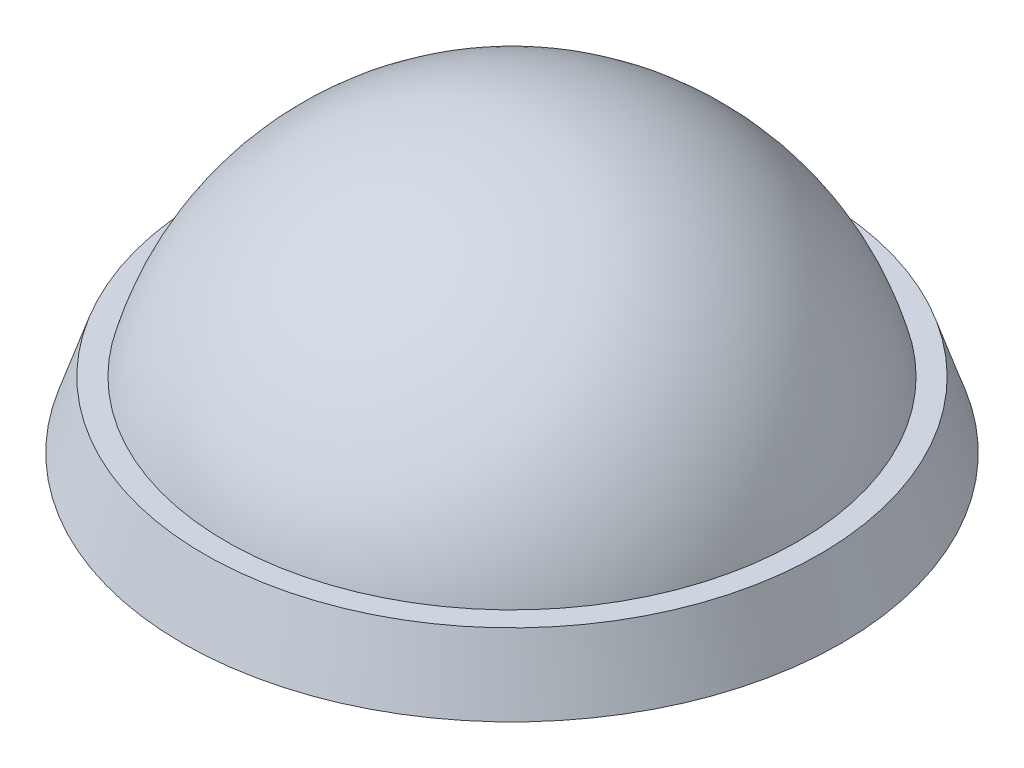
ISO-10303-21;
HEADER;
FILE_DESCRIPTION(('STEP AP214'),'2;1');
FILE_NAME('part.step','',(''),(''),'','','');
FILE_SCHEMA(('AUTOMOTIVE_DESIGN { 1 0 10303 214 1 1 1 1 }'));
ENDSEC;
DATA;
#1=APPLICATION_CONTEXT('core data for automotive mechanical design processes');
#2=APPLICATION_PROTOCOL_DEFINITION('international standard','automotive_design',2000,#1);
#3=PRODUCT_CONTEXT('',#1,'mechanical');
#4=PRODUCT('Part','Part','',(#3));
#5=PRODUCT_RELATED_PRODUCT_CATEGORY('part','',(#4));
#6=PRODUCT_DEFINITION_FORMATION('','',#4);
#7=PRODUCT_DEFINITION_CONTEXT('part definition',#1,'design');
#8=PRODUCT_DEFINITION('design','',#6,#7);
#9=PRODUCT_DEFINITION_SHAPE('','',#8);
#10=(LENGTH_UNIT() NAMED_UNIT(*) SI_UNIT(.MILLI.,.METRE.));
#11=(NAMED_UNIT(*) PLANE_ANGLE_UNIT() SI_UNIT($,.RADIAN.));
#12=(NAMED_UNIT(*) SI_UNIT($,.STERADIAN.) SOLID_ANGLE_UNIT());
#13=UNCERTAINTY_MEASURE_WITH_UNIT(LENGTH_MEASURE(1.E-05),#10,'distance_accuracy_value','');
#14=(GEOMETRIC_REPRESENTATION_CONTEXT(3) GLOBAL_UNCERTAINTY_ASSIGNED_CONTEXT((#13)) GLOBAL_UNIT_ASSIGNED_CONTEXT((#10,
#11,#12)) REPRESENTATION_CONTEXT('',''));
#15=CARTESIAN_POINT('',(0.,0.,0.));
#16=DIRECTION('',(0.,0.,1.));
#17=DIRECTION('',(1.,0.,0.));
#18=AXIS2_PLACEMENT_3D('',#15,#16,#17);
#19=CARTESIAN_POINT('',(14.8278025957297,0.,0.));
#20=DIRECTION('',(0.,-1.,0.));
#21=DIRECTION('',(0.,0.,-1.));
#22=AXIS2_PLACEMENT_3D('',#19,#20,#21);
#23=PLANE('',#22);
#24=CARTESIAN_POINT('',(4.8278025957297,0.,0.));
#25=DIRECTION('',(0.,-1.,0.));
#26=DIRECTION('',(0.,0.,-1.));
#27=AXIS2_PLACEMENT_3D('',#24,#25,#26);
#28=CIRCLE('',#27,15.);
#29=CARTESIAN_POINT('',(4.8278025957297,0.,-15.));
#30=VERTEX_POINT('',#29);
#31=EDGE_CURVE('E50',#30,#30,#28,.T.);
#32=ORIENTED_EDGE('',*,*,#31,.T.);
#33=EDGE_LOOP('',(#32));
#34=FACE_BOUND('',#33,.T.);
#35=CARTESIAN_POINT('',(4.8278025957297,0.,0.));
#36=DIRECTION('',(0.,-1.,0.));
#37=DIRECTION('',(0.,0.,-1.));
#38=AXIS2_PLACEMENT_3D('',#35,#36,#37);
#39=CIRCLE('',#38,10.);
#40=CARTESIAN_POINT('',(4.8278025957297,0.,-10.));
#41=VERTEX_POINT('',#40);
#42=EDGE_CURVE('E10',#41,#41,#39,.T.);
#43=ORIENTED_EDGE('',*,*,#42,.F.);
#44=EDGE_LOOP('',(#43));
#45=FACE_BOUND('',#44,.T.);
#46=ADVANCED_FACE('F31',(#34,#45),#23,.T.);
#47=CARTESIAN_POINT('',(4.8278025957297,3.,0.));
#48=DIRECTION('',(0.,1.,0.));
#49=DIRECTION('',(0.,0.,1.));
#50=AXIS2_PLACEMENT_3D('',#47,#48,#49);
#51=CONICAL_SURFACE('',#50,10.0016948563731,0.000564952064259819);
#52=ORIENTED_EDGE('',*,*,#42,.T.);
#53=EDGE_LOOP('',(#52));
#54=FACE_BOUND('',#53,.T.);
#55=CARTESIAN_POINT('',(4.8278025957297,3.,0.));
#56=DIRECTION('',(0.,-1.,0.));
#57=DIRECTION('',(0.,0.,-1.));
#58=AXIS2_PLACEMENT_3D('',#55,#56,#57);
#59=CIRCLE('',#58,10.0016948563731);
#60=CARTESIAN_POINT('',(4.8278025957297,3.,-10.0016948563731));
#61=VERTEX_POINT('',#60);
#62=EDGE_CURVE('E37',#61,#61,#59,.T.);
#63=ORIENTED_EDGE('',*,*,#62,.F.);
#64=EDGE_LOOP('',(#63));
#65=FACE_BOUND('',#64,.T.);
#66=ADVANCED_FACE('F68',(#54,#65),#51,.F.);
#67=CARTESIAN_POINT('',(4.8278025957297,-0.450000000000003,0.));
#68=DIRECTION('',(0.,-1.,0.));
#69=DIRECTION('',(-1.,0.,0.));
#70=AXIS2_PLACEMENT_3D('',#67,#68,#69);
#71=SPHERICAL_SURFACE('',#70,10.58);
#72=ORIENTED_EDGE('',*,*,#62,.T.);
#73=EDGE_LOOP('',(#72));
#74=FACE_BOUND('',#73,.T.);
#75=ADVANCED_FACE('F72',(#74),#71,.F.);
#76=CARTESIAN_POINT('',(4.8278025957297,-0.450000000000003,0.));
#77=DIRECTION('',(0.,-1.,0.));
#78=DIRECTION('',(1.,0.,0.));
#79=AXIS2_PLACEMENT_3D('',#76,#77,#78);
#80=SPHERICAL_SURFACE('',#79,13.45);
#81=CARTESIAN_POINT('',(4.8278025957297,3.,0.));
#82=DIRECTION('',(0.,-1.,0.));
#83=DIRECTION('',(0.,0.,-1.));
#84=AXIS2_PLACEMENT_3D('',#81,#82,#83);
#85=CIRCLE('',#84,13.);
#86=CARTESIAN_POINT('',(4.8278025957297,3.,-13.));
#87=VERTEX_POINT('',#86);
#88=EDGE_CURVE('E41',#87,#87,#85,.T.);
#89=ORIENTED_EDGE('',*,*,#88,.F.);
#90=EDGE_LOOP('',(#89));
#91=FACE_BOUND('',#90,.T.);
#92=ADVANCED_FACE('F64',(#91),#80,.T.);
#93=CARTESIAN_POINT('',(18.8278025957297,3.,0.));
#94=DIRECTION('',(0.,1.,0.));
#95=DIRECTION('',(0.,0.,1.));
#96=AXIS2_PLACEMENT_3D('',#93,#94,#95);
#97=PLANE('',#96);
#98=ORIENTED_EDGE('',*,*,#88,.T.);
#99=EDGE_LOOP('',(#98));
#100=FACE_BOUND('',#99,.T.);
#101=CARTESIAN_POINT('',(4.8278025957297,3.,0.));
#102=DIRECTION('',(0.,-1.,0.));
#103=DIRECTION('',(0.,0.,-1.));
#104=AXIS2_PLACEMENT_3D('',#101,#102,#103);
#105=CIRCLE('',#104,14.);
#106=CARTESIAN_POINT('',(4.8278025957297,3.,-14.));
#107=VERTEX_POINT('',#106);
#108=EDGE_CURVE('E45',#107,#107,#105,.T.);
#109=ORIENTED_EDGE('',*,*,#108,.F.);
#110=EDGE_LOOP('',(#109));
#111=FACE_BOUND('',#110,.T.);
#112=ADVANCED_FACE('F58',(#100,#111),#97,.T.);
#113=CARTESIAN_POINT('',(4.8278025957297,0.,0.));
#114=DIRECTION('',(0.,-1.,0.));
#115=DIRECTION('',(0.,0.,-1.));
#116=AXIS2_PLACEMENT_3D('',#113,#114,#115);
#117=CONICAL_SURFACE('',#116,15.,0.321750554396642);
#118=ORIENTED_EDGE('',*,*,#108,.T.);
#119=EDGE_LOOP('',(#118));
#120=FACE_BOUND('',#119,.T.);
#121=ORIENTED_EDGE('',*,*,#31,.F.);
#122=EDGE_LOOP('',(#121));
#123=FACE_BOUND('',#122,.T.);
#124=ADVANCED_FACE('F56',(#120,#123),#117,.T.);
#125=CLOSED_SHELL('',(#46,#66,#75,#92,#112,#124));
#126=MANIFOLD_SOLID_BREP('B2',#125);
#127=ADVANCED_BREP_SHAPE_REPRESENTATION('',(#18,#126),#14);
#128=SHAPE_DEFINITION_REPRESENTATION(#9,#127);
ENDSEC;
END-ISO-10303-21;
